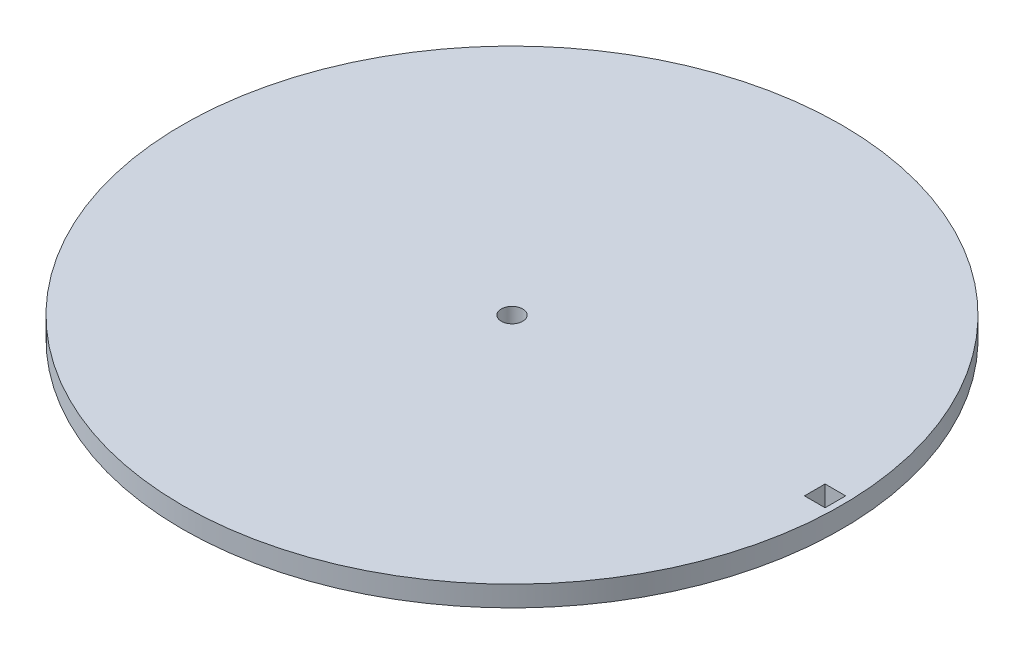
from build123d import *

# Parameters (mm, degrees)
SKETCH1_R           = 50.8
BOSS_EXTRUDE1_DEPTH = 3.175
SKETCH2_R           = 1.651
CUT_EXTRUDE1_DEPTH  = 3.175
SKETCH5_W           = 3.175
SKETCH5_H           = 3.175
CUT_EXTRUDE4_DEPTH  = 3.175


with BuildPart() as part:
    # Sketch1 → Boss-Extrude1 (new body)
    with BuildSketch(Plane(origin=(0, 0, 0), x_dir=(1, 0, 0), z_dir=(0, 1, 0))):
        with Locations(Location((0, 0, 0), (0, 0, 270))):
            Circle(SKETCH1_R)
    extrude(amount=BOSS_EXTRUDE1_DEPTH)

    # Sketch2 → Cut-Extrude1 (cut)
    with BuildSketch(Plane.XZ):
        with Locations(Location((0, 0, 0), (0, 0, 270))):
            Circle(SKETCH2_R)
    extrude(amount=-CUT_EXTRUDE1_DEPTH, mode=Mode.SUBTRACT)

    # Sketch5 → Cut-Extrude4 (cut)
    with BuildSketch(Plane(origin=(0, 3.175, 0), x_dir=(1, 0, 0), z_dir=(0, 1, 0))):
        with Locations((48.26, 0)):
            Rectangle(SKETCH5_W, SKETCH5_H)
    extrude(amount=-CUT_EXTRUDE4_DEPTH, mode=Mode.SUBTRACT)


solid = part.part
